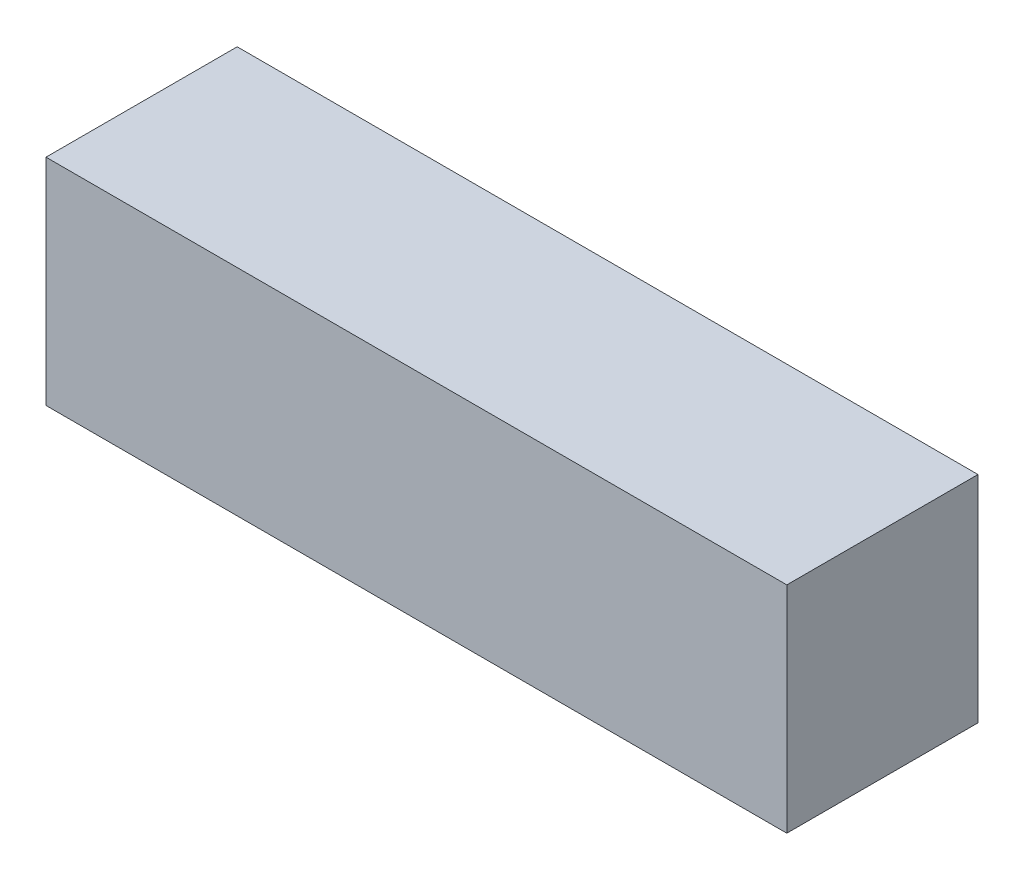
ISO-10303-21;
HEADER;
FILE_DESCRIPTION(('STEP AP214'),'2;1');
FILE_NAME('part.step','',(''),(''),'','','');
FILE_SCHEMA(('AUTOMOTIVE_DESIGN { 1 0 10303 214 1 1 1 1 }'));
ENDSEC;
DATA;
#1=APPLICATION_CONTEXT('core data for automotive mechanical design processes');
#2=APPLICATION_PROTOCOL_DEFINITION('international standard','automotive_design',2000,#1);
#3=PRODUCT_CONTEXT('',#1,'mechanical');
#4=PRODUCT('Part','Part','',(#3));
#5=PRODUCT_RELATED_PRODUCT_CATEGORY('part','',(#4));
#6=PRODUCT_DEFINITION_FORMATION('','',#4);
#7=PRODUCT_DEFINITION_CONTEXT('part definition',#1,'design');
#8=PRODUCT_DEFINITION('design','',#6,#7);
#9=PRODUCT_DEFINITION_SHAPE('','',#8);
#10=(LENGTH_UNIT() NAMED_UNIT(*) SI_UNIT(.MILLI.,.METRE.));
#11=(NAMED_UNIT(*) PLANE_ANGLE_UNIT() SI_UNIT($,.RADIAN.));
#12=(NAMED_UNIT(*) SI_UNIT($,.STERADIAN.) SOLID_ANGLE_UNIT());
#13=UNCERTAINTY_MEASURE_WITH_UNIT(LENGTH_MEASURE(1.E-05),#10,'distance_accuracy_value','');
#14=(GEOMETRIC_REPRESENTATION_CONTEXT(3) GLOBAL_UNCERTAINTY_ASSIGNED_CONTEXT((#13)) GLOBAL_UNIT_ASSIGNED_CONTEXT((#10,
#11,#12)) REPRESENTATION_CONTEXT('',''));
#15=CARTESIAN_POINT('',(0.,0.,0.));
#16=DIRECTION('',(0.,0.,1.));
#17=DIRECTION('',(1.,0.,0.));
#18=AXIS2_PLACEMENT_3D('',#15,#16,#17);
#19=CARTESIAN_POINT('',(0.,0.,8.));
#20=DIRECTION('',(1.,0.,0.));
#21=DIRECTION('',(0.,0.,-1.));
#22=AXIS2_PLACEMENT_3D('',#19,#20,#21);
#23=PLANE('',#22);
#24=DIRECTION('',(0.,-1.,0.));
#25=VECTOR('',#24,1.);
#26=CARTESIAN_POINT('',(0.,0.,0.));
#27=LINE('',#26,#25);
#28=CARTESIAN_POINT('',(0.,9.,0.));
#29=VERTEX_POINT('',#28);
#30=CARTESIAN_POINT('',(0.,0.,0.));
#31=VERTEX_POINT('',#30);
#32=EDGE_CURVE('E94',#29,#31,#27,.T.);
#33=ORIENTED_EDGE('',*,*,#32,.T.);
#34=DIRECTION('',(0.,0.,-1.));
#35=VECTOR('',#34,1.);
#36=CARTESIAN_POINT('',(0.,0.,8.));
#37=LINE('',#36,#35);
#38=CARTESIAN_POINT('',(0.,0.,8.));
#39=VERTEX_POINT('',#38);
#40=EDGE_CURVE('E11',#39,#31,#37,.T.);
#41=ORIENTED_EDGE('',*,*,#40,.F.);
#42=DIRECTION('',(0.,-1.,0.));
#43=VECTOR('',#42,1.);
#44=CARTESIAN_POINT('',(0.,0.,8.));
#45=LINE('',#44,#43);
#46=CARTESIAN_POINT('',(0.,9.,8.));
#47=VERTEX_POINT('',#46);
#48=EDGE_CURVE('E82',#47,#39,#45,.T.);
#49=ORIENTED_EDGE('',*,*,#48,.F.);
#50=DIRECTION('',(0.,0.,-1.));
#51=VECTOR('',#50,1.);
#52=CARTESIAN_POINT('',(0.,9.,8.));
#53=LINE('',#52,#51);
#54=EDGE_CURVE('E90',#47,#29,#53,.T.);
#55=ORIENTED_EDGE('',*,*,#54,.T.);
#56=EDGE_LOOP('',(#33,#41,#49,#55));
#57=FACE_BOUND('',#56,.T.);
#58=ADVANCED_FACE('F31',(#57),#23,.F.);
#59=CARTESIAN_POINT('',(0.,0.,8.));
#60=DIRECTION('',(0.,1.,0.));
#61=DIRECTION('',(0.,0.,1.));
#62=AXIS2_PLACEMENT_3D('',#59,#60,#61);
#63=PLANE('',#62);
#64=DIRECTION('',(1.,0.,0.));
#65=VECTOR('',#64,1.);
#66=CARTESIAN_POINT('',(0.,0.,0.));
#67=LINE('',#66,#65);
#68=CARTESIAN_POINT('',(31.,0.,0.));
#69=VERTEX_POINT('',#68);
#70=EDGE_CURVE('E86',#31,#69,#67,.T.);
#71=ORIENTED_EDGE('',*,*,#70,.T.);
#72=DIRECTION('',(0.,0.,-1.));
#73=VECTOR('',#72,1.);
#74=CARTESIAN_POINT('',(31.,0.,8.));
#75=LINE('',#74,#73);
#76=CARTESIAN_POINT('',(31.,0.,8.));
#77=VERTEX_POINT('',#76);
#78=EDGE_CURVE('E39',#77,#69,#75,.T.);
#79=ORIENTED_EDGE('',*,*,#78,.F.);
#80=DIRECTION('',(1.,0.,0.));
#81=VECTOR('',#80,1.);
#82=CARTESIAN_POINT('',(0.,0.,8.));
#83=LINE('',#82,#81);
#84=EDGE_CURVE('E77',#39,#77,#83,.T.);
#85=ORIENTED_EDGE('',*,*,#84,.F.);
#86=ORIENTED_EDGE('',*,*,#40,.T.);
#87=EDGE_LOOP('',(#71,#79,#85,#86));
#88=FACE_BOUND('',#87,.T.);
#89=ADVANCED_FACE('F85',(#88),#63,.F.);
#90=CARTESIAN_POINT('',(31.,0.,8.));
#91=DIRECTION('',(-1.,0.,0.));
#92=DIRECTION('',(0.,0.,1.));
#93=AXIS2_PLACEMENT_3D('',#90,#91,#92);
#94=PLANE('',#93);
#95=DIRECTION('',(0.,1.,0.));
#96=VECTOR('',#95,1.);
#97=CARTESIAN_POINT('',(31.,0.,0.));
#98=LINE('',#97,#96);
#99=CARTESIAN_POINT('',(31.,9.,0.));
#100=VERTEX_POINT('',#99);
#101=EDGE_CURVE('E64',#69,#100,#98,.T.);
#102=ORIENTED_EDGE('',*,*,#101,.T.);
#103=DIRECTION('',(0.,0.,-1.));
#104=VECTOR('',#103,1.);
#105=CARTESIAN_POINT('',(31.,9.,8.));
#106=LINE('',#105,#104);
#107=CARTESIAN_POINT('',(31.,9.,8.));
#108=VERTEX_POINT('',#107);
#109=EDGE_CURVE('E87',#108,#100,#106,.T.);
#110=ORIENTED_EDGE('',*,*,#109,.F.);
#111=DIRECTION('',(0.,1.,0.));
#112=VECTOR('',#111,1.);
#113=CARTESIAN_POINT('',(31.,0.,8.));
#114=LINE('',#113,#112);
#115=EDGE_CURVE('E80',#77,#108,#114,.T.);
#116=ORIENTED_EDGE('',*,*,#115,.F.);
#117=ORIENTED_EDGE('',*,*,#78,.T.);
#118=EDGE_LOOP('',(#102,#110,#116,#117));
#119=FACE_BOUND('',#118,.T.);
#120=ADVANCED_FACE('F88',(#119),#94,.F.);
#121=CARTESIAN_POINT('',(0.,9.,8.));
#122=DIRECTION('',(0.,-1.,0.));
#123=DIRECTION('',(0.,0.,-1.));
#124=AXIS2_PLACEMENT_3D('',#121,#122,#123);
#125=PLANE('',#124);
#126=DIRECTION('',(-1.,0.,0.));
#127=VECTOR('',#126,1.);
#128=CARTESIAN_POINT('',(0.,9.,0.));
#129=LINE('',#128,#127);
#130=EDGE_CURVE('E70',#100,#29,#129,.T.);
#131=ORIENTED_EDGE('',*,*,#130,.T.);
#132=ORIENTED_EDGE('',*,*,#54,.F.);
#133=DIRECTION('',(-1.,0.,0.));
#134=VECTOR('',#133,1.);
#135=CARTESIAN_POINT('',(0.,9.,8.));
#136=LINE('',#135,#134);
#137=EDGE_CURVE('E47',#108,#47,#136,.T.);
#138=ORIENTED_EDGE('',*,*,#137,.F.);
#139=ORIENTED_EDGE('',*,*,#109,.T.);
#140=EDGE_LOOP('',(#131,#132,#138,#139));
#141=FACE_BOUND('',#140,.T.);
#142=ADVANCED_FACE('F101',(#141),#125,.F.);
#143=CARTESIAN_POINT('',(0.,9.,8.));
#144=DIRECTION('',(0.,0.,-1.));
#145=DIRECTION('',(-1.,0.,0.));
#146=AXIS2_PLACEMENT_3D('',#143,#144,#145);
#147=PLANE('',#146);
#148=ORIENTED_EDGE('',*,*,#48,.T.);
#149=ORIENTED_EDGE('',*,*,#84,.T.);
#150=ORIENTED_EDGE('',*,*,#115,.T.);
#151=ORIENTED_EDGE('',*,*,#137,.T.);
#152=EDGE_LOOP('',(#148,#149,#150,#151));
#153=FACE_BOUND('',#152,.T.);
#154=ADVANCED_FACE('F78',(#153),#147,.F.);
#155=CARTESIAN_POINT('',(0.,9.,0.));
#156=DIRECTION('',(0.,0.,-1.));
#157=DIRECTION('',(-1.,0.,0.));
#158=AXIS2_PLACEMENT_3D('',#155,#156,#157);
#159=PLANE('',#158);
#160=ORIENTED_EDGE('',*,*,#32,.F.);
#161=ORIENTED_EDGE('',*,*,#130,.F.);
#162=ORIENTED_EDGE('',*,*,#101,.F.);
#163=ORIENTED_EDGE('',*,*,#70,.F.);
#164=EDGE_LOOP('',(#160,#161,#162,#163));
#165=FACE_BOUND('',#164,.T.);
#166=ADVANCED_FACE('F104',(#165),#159,.T.);
#167=CLOSED_SHELL('',(#58,#89,#120,#142,#154,#166));
#168=MANIFOLD_SOLID_BREP('B2',#167);
#169=ADVANCED_BREP_SHAPE_REPRESENTATION('',(#18,#168),#14);
#170=SHAPE_DEFINITION_REPRESENTATION(#9,#169);
ENDSEC;
END-ISO-10303-21;
